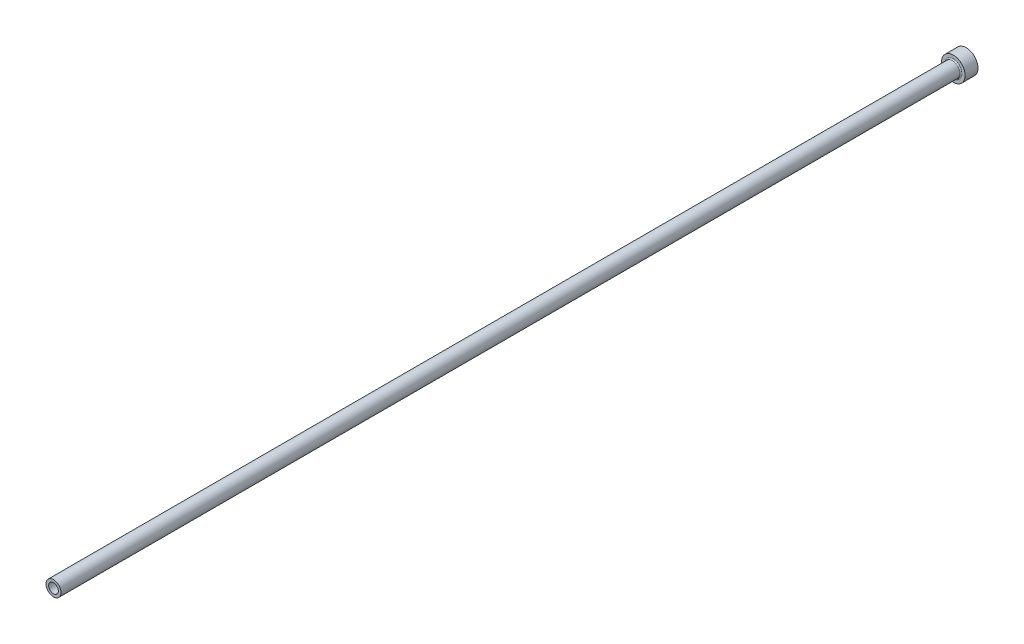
ISO-10303-21;
HEADER;
FILE_DESCRIPTION(('STEP AP214'),'2;1');
FILE_NAME('part.step','',(''),(''),'','','');
FILE_SCHEMA(('AUTOMOTIVE_DESIGN { 1 0 10303 214 1 1 1 1 }'));
ENDSEC;
DATA;
#1=APPLICATION_CONTEXT('core data for automotive mechanical design processes');
#2=APPLICATION_PROTOCOL_DEFINITION('international standard','automotive_design',2000,#1);
#3=PRODUCT_CONTEXT('',#1,'mechanical');
#4=PRODUCT('Part','Part','',(#3));
#5=PRODUCT_RELATED_PRODUCT_CATEGORY('part','',(#4));
#6=PRODUCT_DEFINITION_FORMATION('','',#4);
#7=PRODUCT_DEFINITION_CONTEXT('part definition',#1,'design');
#8=PRODUCT_DEFINITION('design','',#6,#7);
#9=PRODUCT_DEFINITION_SHAPE('','',#8);
#10=(LENGTH_UNIT() NAMED_UNIT(*) SI_UNIT(.MILLI.,.METRE.));
#11=(NAMED_UNIT(*) PLANE_ANGLE_UNIT() SI_UNIT($,.RADIAN.));
#12=(NAMED_UNIT(*) SI_UNIT($,.STERADIAN.) SOLID_ANGLE_UNIT());
#13=UNCERTAINTY_MEASURE_WITH_UNIT(LENGTH_MEASURE(1.E-05),#10,'distance_accuracy_value','');
#14=(GEOMETRIC_REPRESENTATION_CONTEXT(3) GLOBAL_UNCERTAINTY_ASSIGNED_CONTEXT((#13)) GLOBAL_UNIT_ASSIGNED_CONTEXT((#10,
#11,#12)) REPRESENTATION_CONTEXT('',''));
#15=CARTESIAN_POINT('',(0.,0.,0.));
#16=DIRECTION('',(0.,0.,1.));
#17=DIRECTION('',(1.,0.,0.));
#18=AXIS2_PLACEMENT_3D('',#15,#16,#17);
#19=CARTESIAN_POINT('',(0.,0.,425.));
#20=DIRECTION('',(0.,0.,-1.));
#21=DIRECTION('',(-1.,0.,0.));
#22=AXIS2_PLACEMENT_3D('',#19,#20,#21);
#23=PLANE('',#22);
#24=CARTESIAN_POINT('',(0.,0.,425.));
#25=DIRECTION('',(0.,0.,1.));
#26=DIRECTION('',(1.,0.,0.));
#27=AXIS2_PLACEMENT_3D('',#24,#25,#26);
#28=CIRCLE('',#27,2.24999999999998);
#29=CARTESIAN_POINT('',(2.24999999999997,0.,425.));
#30=VERTEX_POINT('',#29);
#31=EDGE_CURVE('E63',#30,#30,#28,.T.);
#32=ORIENTED_EDGE('',*,*,#31,.F.);
#33=EDGE_LOOP('',(#32));
#34=FACE_BOUND('',#33,.T.);
#35=CARTESIAN_POINT('',(0.,0.,425.));
#36=DIRECTION('',(0.,0.,1.));
#37=DIRECTION('',(1.,0.,0.));
#38=AXIS2_PLACEMENT_3D('',#35,#36,#37);
#39=CIRCLE('',#38,3.49999999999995);
#40=CARTESIAN_POINT('',(3.49999999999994,0.,425.));
#41=VERTEX_POINT('',#40);
#42=EDGE_CURVE('E54',#41,#41,#39,.T.);
#43=ORIENTED_EDGE('',*,*,#42,.T.);
#44=EDGE_LOOP('',(#43));
#45=FACE_BOUND('',#44,.T.);
#46=ADVANCED_FACE('F34',(#34,#45),#23,.F.);
#47=CARTESIAN_POINT('',(0.,0.,425.));
#48=DIRECTION('',(0.,0.,1.));
#49=DIRECTION('',(1.,0.,0.));
#50=AXIS2_PLACEMENT_3D('',#47,#48,#49);
#51=CYLINDRICAL_SURFACE('',#50,3.49999999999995);
#52=CARTESIAN_POINT('',(0.,0.,6.50000000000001));
#53=DIRECTION('',(0.,0.,1.));
#54=DIRECTION('',(1.,0.,0.));
#55=AXIS2_PLACEMENT_3D('',#52,#53,#54);
#56=CIRCLE('',#55,3.49999999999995);
#57=CARTESIAN_POINT('',(3.49999999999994,0.,6.50000000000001));
#58=VERTEX_POINT('',#57);
#59=EDGE_CURVE('E49',#58,#58,#56,.T.);
#60=ORIENTED_EDGE('',*,*,#59,.T.);
#61=EDGE_LOOP('',(#60));
#62=FACE_BOUND('',#61,.T.);
#63=ORIENTED_EDGE('',*,*,#42,.F.);
#64=EDGE_LOOP('',(#63));
#65=FACE_BOUND('',#64,.T.);
#66=ADVANCED_FACE('F92',(#62,#65),#51,.T.);
#67=CARTESIAN_POINT('',(0.,0.,6.));
#68=DIRECTION('',(0.,0.,1.));
#69=DIRECTION('',(1.,0.,0.));
#70=AXIS2_PLACEMENT_3D('',#67,#68,#69);
#71=PLANE('',#70);
#72=CARTESIAN_POINT('',(0.,0.,6.));
#73=DIRECTION('',(0.,0.,1.));
#74=DIRECTION('',(1.,0.,0.));
#75=AXIS2_PLACEMENT_3D('',#72,#73,#74);
#76=CIRCLE('',#75,3.99999999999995);
#77=CARTESIAN_POINT('',(3.99999999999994,0.,6.));
#78=VERTEX_POINT('',#77);
#79=EDGE_CURVE('E45',#78,#78,#76,.F.);
#80=ORIENTED_EDGE('',*,*,#79,.T.);
#81=EDGE_LOOP('',(#80));
#82=FACE_BOUND('',#81,.T.);
#83=CARTESIAN_POINT('',(0.,0.,6.00000000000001));
#84=DIRECTION('',(0.,0.,1.));
#85=DIRECTION('',(1.,0.,0.));
#86=AXIS2_PLACEMENT_3D('',#83,#84,#85);
#87=CIRCLE('',#86,5.49999999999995);
#88=CARTESIAN_POINT('',(5.49999999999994,0.,6.00000000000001));
#89=VERTEX_POINT('',#88);
#90=EDGE_CURVE('E57',#89,#89,#87,.T.);
#91=ORIENTED_EDGE('',*,*,#90,.T.);
#92=EDGE_LOOP('',(#91));
#93=FACE_BOUND('',#92,.T.);
#94=ADVANCED_FACE('F98',(#82,#93),#71,.T.);
#95=CARTESIAN_POINT('',(0.,0.,425.));
#96=DIRECTION('',(0.,0.,1.));
#97=DIRECTION('',(1.,0.,0.));
#98=AXIS2_PLACEMENT_3D('',#95,#96,#97);
#99=CYLINDRICAL_SURFACE('',#98,5.49999999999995);
#100=ORIENTED_EDGE('',*,*,#90,.F.);
#101=EDGE_LOOP('',(#100));
#102=FACE_BOUND('',#101,.T.);
#103=CARTESIAN_POINT('',(0.,0.,0.));
#104=DIRECTION('',(0.,0.,1.));
#105=DIRECTION('',(1.,0.,0.));
#106=AXIS2_PLACEMENT_3D('',#103,#104,#105);
#107=CIRCLE('',#106,5.49999999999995);
#108=CARTESIAN_POINT('',(5.49999999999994,0.,0.));
#109=VERTEX_POINT('',#108);
#110=EDGE_CURVE('E60',#109,#109,#107,.T.);
#111=ORIENTED_EDGE('',*,*,#110,.T.);
#112=EDGE_LOOP('',(#111));
#113=FACE_BOUND('',#112,.T.);
#114=ADVANCED_FACE('F89',(#102,#113),#99,.T.);
#115=CARTESIAN_POINT('',(0.,0.,0.));
#116=DIRECTION('',(0.,0.,1.));
#117=DIRECTION('',(1.,0.,0.));
#118=AXIS2_PLACEMENT_3D('',#115,#116,#117);
#119=PLANE('',#118);
#120=CARTESIAN_POINT('',(0.,0.,0.));
#121=DIRECTION('',(0.,0.,1.));
#122=DIRECTION('',(1.,0.,0.));
#123=AXIS2_PLACEMENT_3D('',#120,#121,#122);
#124=CIRCLE('',#123,2.99999999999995);
#125=CARTESIAN_POINT('',(2.99999999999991,0.,0.));
#126=VERTEX_POINT('',#125);
#127=EDGE_CURVE('E41',#126,#126,#124,.T.);
#128=ORIENTED_EDGE('',*,*,#127,.T.);
#129=EDGE_LOOP('',(#128));
#130=FACE_BOUND('',#129,.T.);
#131=ORIENTED_EDGE('',*,*,#110,.F.);
#132=EDGE_LOOP('',(#131));
#133=FACE_BOUND('',#132,.T.);
#134=ADVANCED_FACE('F83',(#130,#133),#119,.F.);
#135=CARTESIAN_POINT('',(0.,0.,425.));
#136=DIRECTION('',(0.,0.,1.));
#137=DIRECTION('',(1.,0.,0.));
#138=AXIS2_PLACEMENT_3D('',#135,#136,#137);
#139=CYLINDRICAL_SURFACE('',#138,2.25);
#140=ORIENTED_EDGE('',*,*,#31,.T.);
#141=EDGE_LOOP('',(#140));
#142=FACE_BOUND('',#141,.T.);
#143=CARTESIAN_POINT('',(0.,0.,275.));
#144=DIRECTION('',(0.,0.,1.));
#145=DIRECTION('',(1.,0.,0.));
#146=AXIS2_PLACEMENT_3D('',#143,#144,#145);
#147=CIRCLE('',#146,2.25000000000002);
#148=CARTESIAN_POINT('',(2.25,0.,275.));
#149=VERTEX_POINT('',#148);
#150=EDGE_CURVE('E66',#149,#149,#147,.T.);
#151=ORIENTED_EDGE('',*,*,#150,.F.);
#152=EDGE_LOOP('',(#151));
#153=FACE_BOUND('',#152,.T.);
#154=ADVANCED_FACE('F78',(#142,#153),#139,.F.);
#155=CARTESIAN_POINT('',(0.,0.,275.));
#156=DIRECTION('',(0.,0.,-1.));
#157=DIRECTION('',(-1.,0.,0.));
#158=AXIS2_PLACEMENT_3D('',#155,#156,#157);
#159=CONICAL_SURFACE('',#158,2.25000000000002,0.523598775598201);
#160=CARTESIAN_POINT('',(0.,0.,274.566987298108));
#161=DIRECTION('',(0.,0.,1.));
#162=DIRECTION('',(1.,0.,0.));
#163=AXIS2_PLACEMENT_3D('',#160,#161,#162);
#164=CIRCLE('',#163,2.49999999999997);
#165=CARTESIAN_POINT('',(2.49999999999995,0.,274.566987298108));
#166=VERTEX_POINT('',#165);
#167=EDGE_CURVE('E69',#166,#166,#164,.T.);
#168=ORIENTED_EDGE('',*,*,#167,.F.);
#169=EDGE_LOOP('',(#168));
#170=FACE_BOUND('',#169,.T.);
#171=ORIENTED_EDGE('',*,*,#150,.T.);
#172=EDGE_LOOP('',(#171));
#173=FACE_BOUND('',#172,.T.);
#174=ADVANCED_FACE('F75',(#170,#173),#159,.F.);
#175=CARTESIAN_POINT('',(0.,0.,425.));
#176=DIRECTION('',(0.,0.,1.));
#177=DIRECTION('',(1.,0.,0.));
#178=AXIS2_PLACEMENT_3D('',#175,#176,#177);
#179=CYLINDRICAL_SURFACE('',#178,2.49999999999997);
#180=CARTESIAN_POINT('',(0.,0.,0.499999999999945));
#181=DIRECTION('',(0.,0.,1.));
#182=DIRECTION('',(1.,0.,0.));
#183=AXIS2_PLACEMENT_3D('',#180,#181,#182);
#184=CIRCLE('',#183,2.49999999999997);
#185=CARTESIAN_POINT('',(2.49999999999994,0.,0.499999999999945));
#186=VERTEX_POINT('',#185);
#187=EDGE_CURVE('E10',#186,#186,#184,.F.);
#188=ORIENTED_EDGE('',*,*,#187,.T.);
#189=EDGE_LOOP('',(#188));
#190=FACE_BOUND('',#189,.T.);
#191=ORIENTED_EDGE('',*,*,#167,.T.);
#192=EDGE_LOOP('',(#191));
#193=FACE_BOUND('',#192,.T.);
#194=ADVANCED_FACE('F73',(#190,#193),#179,.F.);
#195=CARTESIAN_POINT('',(0.,0.,6.50000000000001));
#196=DIRECTION('',(0.,0.,1.));
#197=DIRECTION('',(1.,0.,0.));
#198=AXIS2_PLACEMENT_3D('',#195,#196,#197);
#199=TOROIDAL_SURFACE('',#198,3.99999999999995,0.5);
#200=ORIENTED_EDGE('',*,*,#79,.F.);
#201=EDGE_LOOP('',(#200));
#202=FACE_BOUND('',#201,.T.);
#203=ORIENTED_EDGE('',*,*,#59,.F.);
#204=EDGE_LOOP('',(#203));
#205=FACE_BOUND('',#204,.T.);
#206=ADVANCED_FACE('F104',(#202,#205),#199,.F.);
#207=CARTESIAN_POINT('',(0.,0.,0.));
#208=DIRECTION('',(0.,0.,-1.));
#209=DIRECTION('',(-1.,0.,0.));
#210=AXIS2_PLACEMENT_3D('',#207,#208,#209);
#211=CONICAL_SURFACE('',#210,2.99999999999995,0.785398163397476);
#212=ORIENTED_EDGE('',*,*,#187,.F.);
#213=EDGE_LOOP('',(#212));
#214=FACE_BOUND('',#213,.T.);
#215=ORIENTED_EDGE('',*,*,#127,.F.);
#216=EDGE_LOOP('',(#215));
#217=FACE_BOUND('',#216,.T.);
#218=ADVANCED_FACE('F36',(#214,#217),#211,.F.);
#219=CLOSED_SHELL('',(#46,#66,#94,#114,#134,#154,#174,#194,#206,#218));
#220=MANIFOLD_SOLID_BREP('B2',#219);
#221=ADVANCED_BREP_SHAPE_REPRESENTATION('',(#18,#220),#14);
#222=SHAPE_DEFINITION_REPRESENTATION(#9,#221);
ENDSEC;
END-ISO-10303-21;
